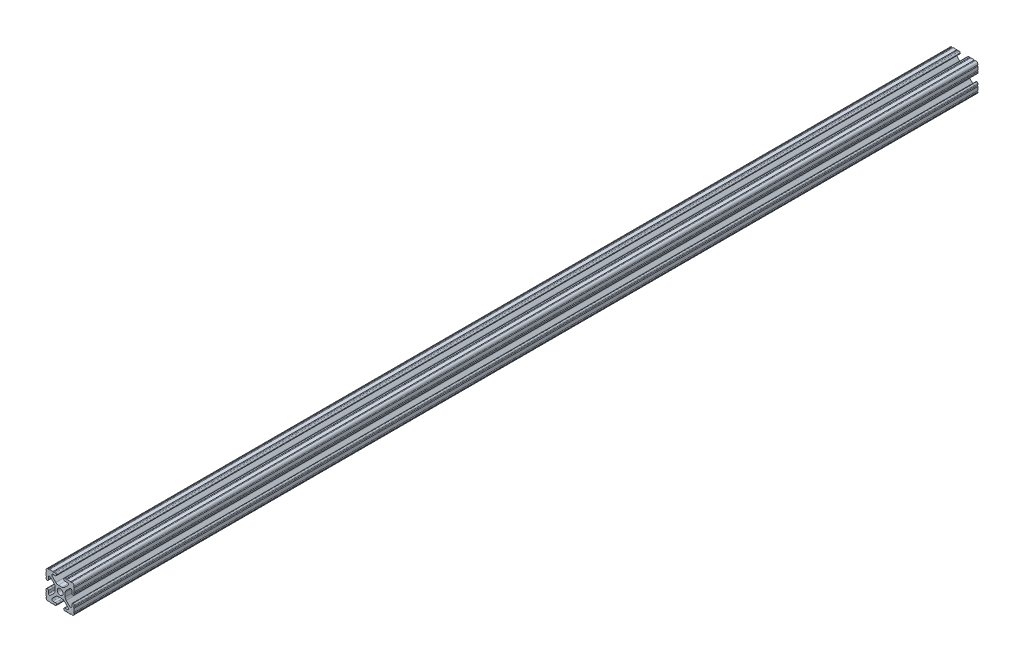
from build123d import *

# Parameters (mm, degrees)
SKETCH1_R      = 2.6035
EXTRUDE1_DEPTH = 812.8


with BuildPart() as part:
    # Sketch1 → Extrude1 (new body)
    with BuildSketch(Plane.XY):
        with BuildLine():
            Line((-7.207036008, 8.724370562), (-3.898272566, 5.423169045))
            ThreePointArc((-3.898272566, 5.423169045), (-2.869120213, 4.736787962), (-1.655778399, 4.4958))
            Line((-1.655778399, 4.4958), (1.655778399, 4.4958))
            ThreePointArc((1.655778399, 4.4958), (2.869120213, 4.736787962), (3.898272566, 5.423169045))
            Line((3.898272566, 5.423169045), (7.207036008, 8.724370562))
            ThreePointArc((7.207036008, 8.724370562), (7.432222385, 9.85140422), (6.476788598, 10.4902))
            Line((6.476788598, 10.4902), (4.287512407, 10.4902))
            ThreePointArc((4.287512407, 10.4902), (3.54574862, 10.79744862), (3.2385, 11.539212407))
            Line((3.2385, 11.539212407), (3.2385, 11.650987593))
            ThreePointArc((3.2385, 11.650987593), (3.54574862, 12.39275138), (4.287512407, 12.7))
            Line((4.287512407, 12.7), (5.317126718, 12.7))
            ThreePointArc((5.317126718, 12.7), (5.825126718, 12.192), (6.333126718, 12.7))
            Line((6.333126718, 12.7), (9.550443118, 12.7))
            ThreePointArc((9.550443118, 12.7), (10.058366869, 12.192000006), (10.566443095, 12.699847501))
            ThreePointArc((10.566443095, 12.699847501), (12.082537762, 12.08250727), (12.699846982, 10.566399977))
            ThreePointArc((12.699846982, 10.566399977), (12.192000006, 10.058323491), (12.7, 9.5504))
            Line((12.7, 9.5504), (12.7, 6.3330836))
            ThreePointArc((12.7, 6.3330836), (12.192, 5.8250836), (12.7, 5.3170836))
            Line((12.7, 5.3170836), (12.7, 4.287469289))
            ThreePointArc((12.7, 4.287469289), (12.39275138, 3.545705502), (11.650987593, 3.238456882))
            Line((11.650987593, 3.238456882), (11.539212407, 3.238456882))
            ThreePointArc((11.539212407, 3.238456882), (10.79744862, 3.545705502), (10.4902, 4.287469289))
            Line((10.4902, 4.287469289), (10.4902, 6.402089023))
            ThreePointArc((10.4902, 6.402089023), (9.856505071, 7.351067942), (8.737131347, 7.129408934))
            Line((8.737131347, 7.129408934), (5.441005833, 3.840816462))
            ThreePointArc((5.441005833, 3.840816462), (4.750877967, 2.809883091), (4.5085, 1.593185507))
            Line((4.5085, 1.593185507), (4.5085, -1.593185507))
            ThreePointArc((4.5085, -1.593185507), (4.750877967, -2.809883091), (5.441005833, -3.840816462))
            Line((5.441005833, -3.840816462), (8.737131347, -7.129408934))
            ThreePointArc((8.737131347, -7.129408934), (9.856505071, -7.351067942), (10.4902, -6.402089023))
            Line((10.4902, -6.402089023), (10.4902, -4.287469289))
            ThreePointArc((10.4902, -4.287469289), (10.79744862, -3.545705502), (11.539212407, -3.238456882))
            Line((11.539212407, -3.238456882), (11.650987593, -3.238456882))
            ThreePointArc((11.650987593, -3.238456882), (12.39275138, -3.545705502), (12.7, -4.287469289))
            Line((12.7, -4.287469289), (12.7, -5.3170836))
            ThreePointArc((12.7, -5.3170836), (12.192, -5.8250836), (12.7, -6.3330836))
            Line((12.7, -6.3330836), (12.7, -9.5504))
            ThreePointArc((12.7, -9.5504), (12.192000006, -10.058323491), (12.699846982, -10.566399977))
            ThreePointArc((12.699846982, -10.566399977), (12.082537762, -12.08250727), (10.566443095, -12.699847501))
            ThreePointArc((10.566443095, -12.699847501), (10.058366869, -12.192000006), (9.550443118, -12.7))
            Line((9.550443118, -12.7), (6.333126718, -12.7))
            ThreePointArc((6.333126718, -12.7), (5.825126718, -12.192), (5.317126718, -12.7))
            Line((5.317126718, -12.7), (4.287512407, -12.7))
            ThreePointArc((4.287512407, -12.7), (3.54574862, -12.39275138), (3.2385, -11.650987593))
            Line((3.2385, -11.650987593), (3.2385, -11.539212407))
            ThreePointArc((3.2385, -11.539212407), (3.54574862, -10.79744862), (4.287512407, -10.4902))
            Line((4.287512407, -10.4902), (6.416408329, -10.4902))
            ThreePointArc((6.416408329, -10.4902), (7.41473083, -9.822813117), (7.179650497, -8.645192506))
            Line((7.179650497, -8.645192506), (3.952270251, -5.423690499))
            ThreePointArc((3.952270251, -5.423690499), (2.922936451, -4.736929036), (1.709253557, -4.4958))
            Line((1.709253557, -4.4958), (-1.709253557, -4.4958))
            ThreePointArc((-1.709253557, -4.4958), (-2.922936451, -4.736929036), (-3.952270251, -5.423690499))
            Line((-3.952270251, -5.423690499), (-7.179650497, -8.645192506))
            ThreePointArc((-7.179650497, -8.645192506), (-7.41473083, -9.822813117), (-6.416408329, -10.4902))
            Line((-6.416408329, -10.4902), (-4.287512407, -10.4902))
            ThreePointArc((-4.287512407, -10.4902), (-3.54574862, -10.79744862), (-3.2385, -11.539212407))
            Line((-3.2385, -11.539212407), (-3.2385, -11.650987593))
            ThreePointArc((-3.2385, -11.650987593), (-3.54574862, -12.39275138), (-4.287512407, -12.7))
            Line((-4.287512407, -12.7), (-5.317126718, -12.7))
            ThreePointArc((-5.317126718, -12.7), (-5.825126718, -12.192), (-6.333126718, -12.7))
            Line((-6.333126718, -12.7), (-9.550443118, -12.7))
            ThreePointArc((-9.550443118, -12.7), (-10.058366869, -12.192000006), (-10.566443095, -12.699847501))
            ThreePointArc((-10.566443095, -12.699847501), (-12.082537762, -12.08250727), (-12.699846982, -10.566399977))
            ThreePointArc((-12.699846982, -10.566399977), (-12.192000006, -10.058323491), (-12.7, -9.5504))
            Line((-12.7, -9.5504), (-12.7, -6.3330836))
            ThreePointArc((-12.7, -6.3330836), (-12.192, -5.8250836), (-12.7, -5.3170836))
            Line((-12.7, -5.3170836), (-12.7, -4.287469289))
            ThreePointArc((-12.7, -4.287469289), (-12.39275138, -3.545705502), (-11.650987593, -3.238456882))
            Line((-11.650987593, -3.238456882), (-11.539212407, -3.238456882))
            ThreePointArc((-11.539212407, -3.238456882), (-10.79744862, -3.545705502), (-10.4902, -4.287469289))
            Line((-10.4902, -4.287469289), (-10.4902, -6.402089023))
            ThreePointArc((-10.4902, -6.402089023), (-9.856505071, -7.351067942), (-8.737131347, -7.129408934))
            Line((-8.737131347, -7.129408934), (-5.441005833, -3.840816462))
            ThreePointArc((-5.441005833, -3.840816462), (-4.750877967, -2.809883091), (-4.5085, -1.593185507))
            Line((-4.5085, -1.593185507), (-4.5085, 1.593185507))
            ThreePointArc((-4.5085, 1.593185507), (-4.750877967, 2.809883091), (-5.441005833, 3.840816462))
            Line((-5.441005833, 3.840816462), (-8.737131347, 7.129408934))
            ThreePointArc((-8.737131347, 7.129408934), (-9.856505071, 7.351067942), (-10.4902, 6.402089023))
            Line((-10.4902, 6.402089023), (-10.4902, 4.287469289))
            ThreePointArc((-10.4902, 4.287469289), (-10.79744862, 3.545705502), (-11.539212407, 3.238456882))
            Line((-11.539212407, 3.238456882), (-11.650987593, 3.238456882))
            ThreePointArc((-11.650987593, 3.238456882), (-12.39275138, 3.545705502), (-12.7, 4.287469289))
            Line((-12.7, 4.287469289), (-12.7, 5.3170836))
            ThreePointArc((-12.7, 5.3170836), (-12.192, 5.8250836), (-12.7, 6.3330836))
            Line((-12.7, 6.3330836), (-12.7, 9.5504))
            ThreePointArc((-12.7, 9.5504), (-12.192000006, 10.058323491), (-12.699846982, 10.566399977))
            ThreePointArc((-12.699846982, 10.566399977), (-12.082537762, 12.08250727), (-10.566443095, 12.699847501))
            ThreePointArc((-10.566443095, 12.699847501), (-10.058366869, 12.192000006), (-9.550443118, 12.7))
            Line((-9.550443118, 12.7), (-6.333126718, 12.7))
            ThreePointArc((-6.333126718, 12.7), (-5.825126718, 12.192), (-5.317126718, 12.7))
            Line((-5.317126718, 12.7), (-4.287512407, 12.7))
            ThreePointArc((-4.287512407, 12.7), (-3.54574862, 12.39275138), (-3.2385, 11.650987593))
            Line((-3.2385, 11.650987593), (-3.2385, 11.539212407))
            ThreePointArc((-3.2385, 11.539212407), (-3.54574862, 10.79744862), (-4.287512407, 10.4902))
            Line((-4.287512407, 10.4902), (-6.476788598, 10.4902))
            ThreePointArc((-6.476788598, 10.4902), (-7.432222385, 9.85140422), (-7.207036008, 8.724370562))
        make_face()
        Circle(SKETCH1_R, mode=Mode.SUBTRACT)
    extrude(amount=-EXTRUDE1_DEPTH)


solid = part.part
